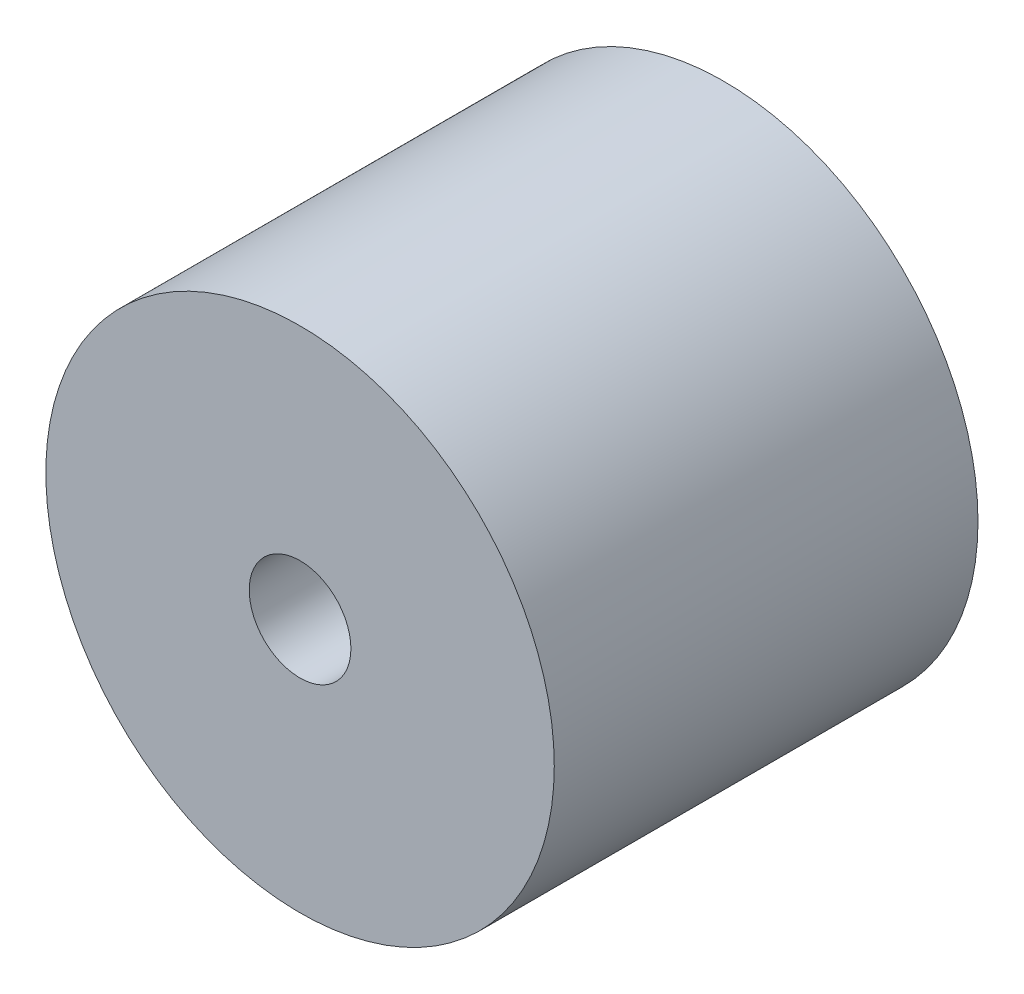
from build123d import *

# Parameters (mm, degrees)
ESQUISSE1_R      = 150
EXTRUSION1_DEPTH = 250


with BuildPart() as part:
    # Esquisse1 → Extrusion1 (new body)
    with BuildSketch(Plane.XY):
        Circle(ESQUISSE1_R)
    extrude(amount=EXTRUSION1_DEPTH)

    # Esquisse2 → Enl_vement de mati_re-R_volution1 (revolve, cut)
    with BuildSketch(Plane(origin=(0, 0, 0), x_dir=(1, 0, 0), z_dir=(0, 1, 0)), mode=Mode.PRIVATE) as enl_vement_de_mati_re_r_volution1_sk:
        Polygon((0, 0), (-130, 0), (-106.905989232, -40), (-86.905989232, -40), (-63.98348174, -170), (-30, -170), (-30, -250), (0, -250), align=None)
    revolve(enl_vement_de_mati_re_r_volution1_sk.sketch.rotate(Axis((0, 0, 0), (0, 0, -1)), 180), axis=Axis((0, 0, 0), (0, 0, -1)), mode=Mode.SUBTRACT)


solid = part.part
